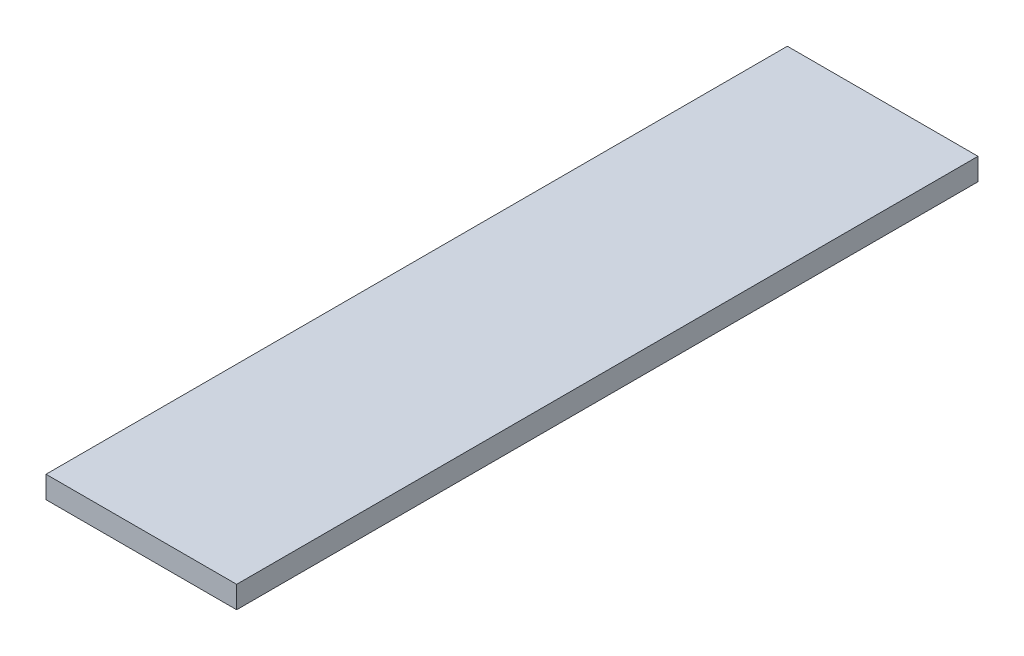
from build123d import *

# Parameters (mm, degrees)
SKETCH3_W           = 61.722
SKETCH3_H           = 7.14375
BOSS_EXTRUDE1_DEPTH = 120


with BuildPart() as part:
    # Sketch3 → Boss-Extrude1 (new, symmetric)
    with BuildSketch(Plane.XY):
        Rectangle(SKETCH3_W, SKETCH3_H)
    extrude(amount=BOSS_EXTRUDE1_DEPTH, both=True)


solid = part.part
